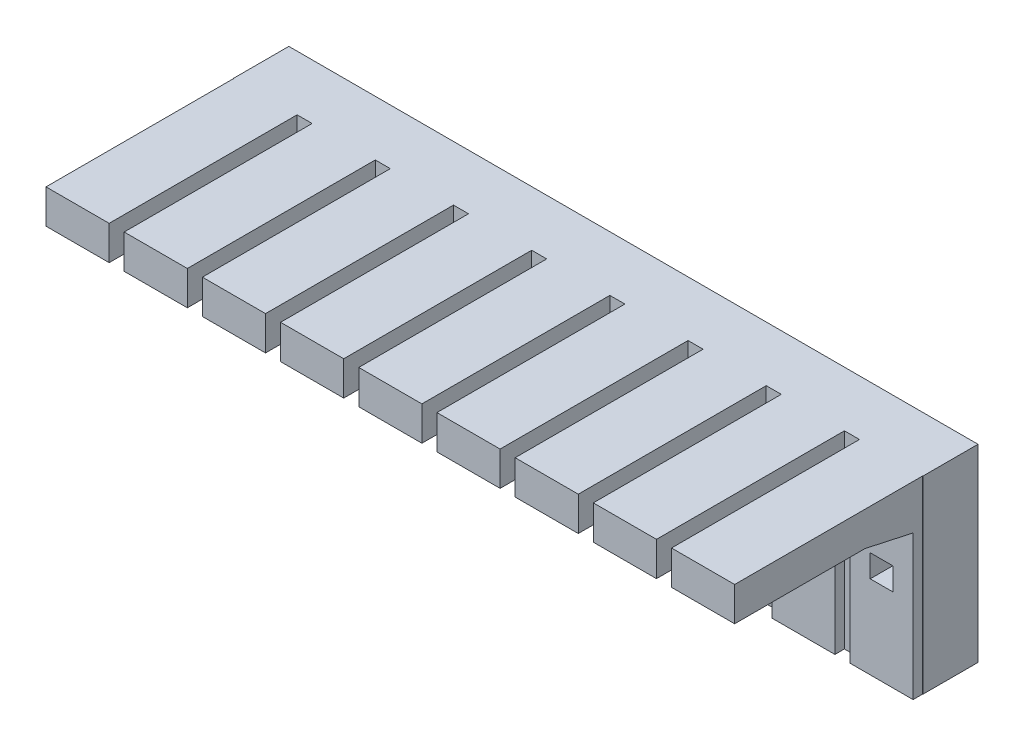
from build123d import *

# Parameters (mm, degrees)
BOSS_EXTRUDE1_DEPTH     = 17.4625
SKETCH2_W               = 0.762
SKETCH2_H               = 9.525
CUT_EXTRUDE1_DEPTH      = 24.417784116
LPATTERN1_COUNT         = 5
LPATTERN1_PITCH         = 3.9624
MIRROR1_COPY_1_SKETCH_W = 0.762
MIRROR1_COPY_1_SKETCH_H = 9.525
MIRROR1_COPY_1_DEPTH    = 24.417784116
MIRROR1_COPY_2_SKETCH_W = 0.762
MIRROR1_COPY_2_SKETCH_H = 9.525
MIRROR1_COPY_2_DEPTH    = 24.417784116
MIRROR1_COPY_3_SKETCH_W = 0.762
MIRROR1_COPY_3_SKETCH_H = 9.525
MIRROR1_COPY_3_DEPTH    = 24.417784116
MIRROR1_COPY_4_SKETCH_W = 0.762
MIRROR1_COPY_4_SKETCH_H = 9.525
MIRROR1_COPY_4_DEPTH    = 24.417784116
SKETCH3_W               = 1.143
SKETCH3_H               = 1.143
CUT_EXTRUDE2_DEPTH      = 22.872353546
LPATTERN2_COUNT         = 5
LPATTERN2_PITCH         = 3.9624
LPATTERN2_COL_COUNT     = 5
LPATTERN2_COL_PITCH     = 3.9624


with BuildPart() as part:
    # Sketch1 → Boss-Extrude1 (new, symmetric)
    with BuildSketch(Plane(origin=(0, 0, 0), x_dir=(0, 0, -1), z_dir=(1, 0, 0))):
        Polygon((0, 0), (0, 9.5758), (-12.319, 9.5758), (-12.319, 7.8486), (-5.715, 7.8486), (-3.2766, 7.3152), (-3.2766, 0), align=None)
    extrude(amount=BOSS_EXTRUDE1_DEPTH, both=True)

    # Sketch2 → Cut-Extrude1 (cut, through all)
    with BuildSketch(Plane(origin=(0, 9.5758, 0), x_dir=(1, 0, 0), z_dir=(0, 1, 0))):
        with Locations((1.9812, -7.5565)):
            Rectangle(SKETCH2_W, SKETCH2_H)
    cut_extrude1 = extrude(amount=-CUT_EXTRUDE1_DEPTH, mode=Mode.SUBTRACT)

    # LPattern1: Cut-Extrude1 ×5
    with Locations(*[(i * LPATTERN1_PITCH, 0, 0) for i in range(1, LPATTERN1_COUNT)]):
        add(cut_extrude1, mode=Mode.SUBTRACT)

    # Mirror1: Cut-Extrude1 across plane
    add(cut_extrude1.mirror(Plane(origin=(0, 0, 0), x_dir=(0, 0, 1), z_dir=(1, 0, 0))), mode=Mode.SUBTRACT)

    # Mirror1 copy 1 sketch → Mirror1 copy 1 (cut, through all)
    with BuildSketch(Plane(origin=(-3.9624, 9.5758, 0), x_dir=(-1, 0, 0), z_dir=(0, 1, 0))):
        with Locations((1.9812, 7.5565)):
            Rectangle(MIRROR1_COPY_1_SKETCH_W, MIRROR1_COPY_1_SKETCH_H)
    extrude(amount=-MIRROR1_COPY_1_DEPTH, mode=Mode.SUBTRACT)

    # Mirror1 copy 2 sketch → Mirror1 copy 2 (cut, through all)
    with BuildSketch(Plane(origin=(-7.9248, 9.5758, 0), x_dir=(-1, 0, 0), z_dir=(0, 1, 0))):
        with Locations((1.9812, 7.5565)):
            Rectangle(MIRROR1_COPY_2_SKETCH_W, MIRROR1_COPY_2_SKETCH_H)
    extrude(amount=-MIRROR1_COPY_2_DEPTH, mode=Mode.SUBTRACT)

    # Mirror1 copy 3 sketch → Mirror1 copy 3 (cut, through all)
    with BuildSketch(Plane(origin=(-11.8872, 9.5758, 0), x_dir=(-1, 0, 0), z_dir=(0, 1, 0))):
        with Locations((1.9812, 7.5565)):
            Rectangle(MIRROR1_COPY_3_SKETCH_W, MIRROR1_COPY_3_SKETCH_H)
    extrude(amount=-MIRROR1_COPY_3_DEPTH, mode=Mode.SUBTRACT)

    # Mirror1 copy 4 sketch → Mirror1 copy 4 (cut, through all)
    with BuildSketch(Plane(origin=(-15.8496, 9.5758, 0), x_dir=(-1, 0, 0), z_dir=(0, 1, 0))):
        with Locations((1.9812, 7.5565)):
            Rectangle(MIRROR1_COPY_4_SKETCH_W, MIRROR1_COPY_4_SKETCH_H)
    extrude(amount=-MIRROR1_COPY_4_DEPTH, mode=Mode.SUBTRACT)

    # Sketch3 → Cut-Extrude2 (cut, through all)
    with BuildSketch(Plane.XY.offset(3.2766)):
        with Locations((0, 4.7879)):
            Rectangle(SKETCH3_W, SKETCH3_H)
    cut_extrude2 = extrude(amount=-CUT_EXTRUDE2_DEPTH, mode=Mode.SUBTRACT)

    # LPattern2: Cut-Extrude2 ×5
    with Locations(*[(-i * LPATTERN2_PITCH, 0, 0) for i in range(1, LPATTERN2_COUNT)]):
        add(cut_extrude2, mode=Mode.SUBTRACT)

    # LPattern2 col: Cut-Extrude2 ×5
    with Locations(*[(i * LPATTERN2_COL_PITCH, 0, 0) for i in range(1, LPATTERN2_COL_COUNT)]):
        add(cut_extrude2, mode=Mode.SUBTRACT)


solid = part.part
